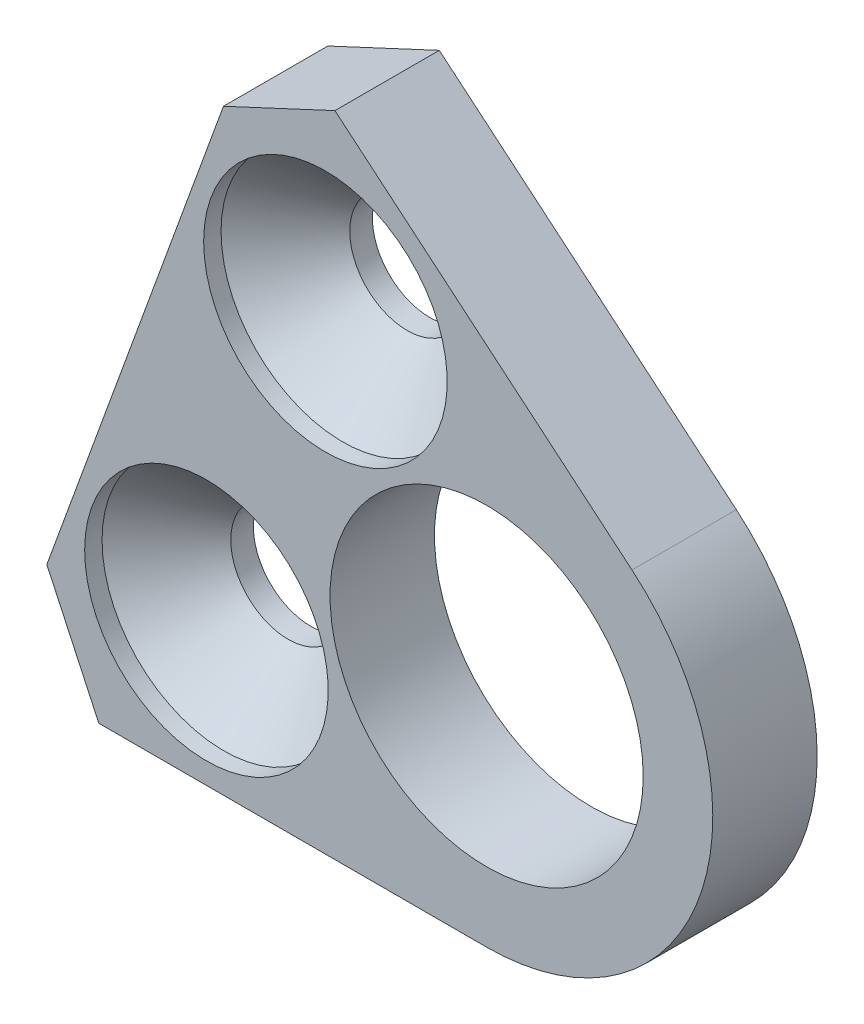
ISO-10303-21;
HEADER;
FILE_DESCRIPTION(('STEP AP214'),'2;1');
FILE_NAME('part.step','',(''),(''),'','','');
FILE_SCHEMA(('AUTOMOTIVE_DESIGN { 1 0 10303 214 1 1 1 1 }'));
ENDSEC;
DATA;
#1=APPLICATION_CONTEXT('core data for automotive mechanical design processes');
#2=APPLICATION_PROTOCOL_DEFINITION('international standard','automotive_design',2000,#1);
#3=PRODUCT_CONTEXT('',#1,'mechanical');
#4=PRODUCT('Part','Part','',(#3));
#5=PRODUCT_RELATED_PRODUCT_CATEGORY('part','',(#4));
#6=PRODUCT_DEFINITION_FORMATION('','',#4);
#7=PRODUCT_DEFINITION_CONTEXT('part definition',#1,'design');
#8=PRODUCT_DEFINITION('design','',#6,#7);
#9=PRODUCT_DEFINITION_SHAPE('','',#8);
#10=(LENGTH_UNIT() NAMED_UNIT(*) SI_UNIT(.MILLI.,.METRE.));
#11=(NAMED_UNIT(*) PLANE_ANGLE_UNIT() SI_UNIT($,.RADIAN.));
#12=(NAMED_UNIT(*) SI_UNIT($,.STERADIAN.) SOLID_ANGLE_UNIT());
#13=UNCERTAINTY_MEASURE_WITH_UNIT(LENGTH_MEASURE(1.E-05),#10,'distance_accuracy_value','');
#14=(GEOMETRIC_REPRESENTATION_CONTEXT(3) GLOBAL_UNCERTAINTY_ASSIGNED_CONTEXT((#13)) GLOBAL_UNIT_ASSIGNED_CONTEXT((#10,
#11,#12)) REPRESENTATION_CONTEXT('',''));
#15=CARTESIAN_POINT('',(0.,0.,0.));
#16=DIRECTION('',(0.,0.,1.));
#17=DIRECTION('',(1.,0.,0.));
#18=AXIS2_PLACEMENT_3D('',#15,#16,#17);
#19=CARTESIAN_POINT('',(-9.26578638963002,14.0137504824,-0.100000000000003));
#20=DIRECTION('',(0.,0.,-1.));
#21=DIRECTION('',(-1.,0.,0.));
#22=AXIS2_PLACEMENT_3D('',#19,#20,#21);
#23=CYLINDRICAL_SURFACE('',#22,7.);
#24=CARTESIAN_POINT('',(-9.26578638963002,14.0137504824,-1.0000000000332));
#25=DIRECTION('',(0.,0.,1.));
#26=DIRECTION('',(0.877582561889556,-0.479425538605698,0.));
#27=AXIS2_PLACEMENT_3D('',#24,#25,#26);
#28=CIRCLE('',#27,6.99999999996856);
#29=CARTESIAN_POINT('',(-16.26578638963,14.0137504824,-1.0000000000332));
#30=VERTEX_POINT('',#29);
#31=EDGE_CURVE('E127',#30,#30,#28,.F.);
#32=CARTESIAN_POINT('',(-9.26578638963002,14.0137504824,0.));
#33=DIRECTION('',(0.,0.,-1.));
#34=DIRECTION('',(-1.,0.,0.));
#35=AXIS2_PLACEMENT_3D('',#32,#33,#34);
#36=CIRCLE('',#35,7.);
#37=CARTESIAN_POINT('',(-16.26578638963,14.0137504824,0.));
#38=VERTEX_POINT('',#37);
#39=EDGE_CURVE('E20',#38,#38,#36,.T.);
#40=CARTESIAN_POINT('',(-16.26578638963,14.0137504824,-1.0000000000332));
#41=CARTESIAN_POINT('',(-16.26578638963,14.0137504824,-0.989583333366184));
#42=CARTESIAN_POINT('',(-16.26578638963,14.0137504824,-0.979166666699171));
#43=CARTESIAN_POINT('',(-16.26578638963,14.0137504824,-0.958333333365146));
#44=CARTESIAN_POINT('',(-16.26578638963,14.0137504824,-0.947916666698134));
#45=CARTESIAN_POINT('',(-16.26578638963,14.0137504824,-0.927083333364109));
#46=CARTESIAN_POINT('',(-16.26578638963,14.0137504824,-0.916666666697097));
#47=CARTESIAN_POINT('',(-16.26578638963,14.0137504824,-0.895833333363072));
#48=CARTESIAN_POINT('',(-16.26578638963,14.0137504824,-0.885416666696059));
#49=CARTESIAN_POINT('',(-16.26578638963,14.0137504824,-0.864583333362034));
#50=CARTESIAN_POINT('',(-16.26578638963,14.0137504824,-0.854166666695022));
#51=CARTESIAN_POINT('',(-16.26578638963,14.0137504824,-0.833333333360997));
#52=CARTESIAN_POINT('',(-16.26578638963,14.0137504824,-0.822916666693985));
#53=CARTESIAN_POINT('',(-16.26578638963,14.0137504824,-0.80208333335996));
#54=CARTESIAN_POINT('',(-16.26578638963,14.0137504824,-0.791666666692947));
#55=CARTESIAN_POINT('',(-16.26578638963,14.0137504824,-0.770833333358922));
#56=CARTESIAN_POINT('',(-16.26578638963,14.0137504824,-0.76041666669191));
#57=CARTESIAN_POINT('',(-16.26578638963,14.0137504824,-0.739583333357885));
#58=CARTESIAN_POINT('',(-16.26578638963,14.0137504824,-0.729166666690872));
#59=CARTESIAN_POINT('',(-16.26578638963,14.0137504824,-0.708333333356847));
#60=CARTESIAN_POINT('',(-16.26578638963,14.0137504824,-0.697916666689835));
#61=CARTESIAN_POINT('',(-16.26578638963,14.0137504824,-0.67708333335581));
#62=CARTESIAN_POINT('',(-16.26578638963,14.0137504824,-0.666666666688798));
#63=CARTESIAN_POINT('',(-16.26578638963,14.0137504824,-0.645833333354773));
#64=CARTESIAN_POINT('',(-16.26578638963,14.0137504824,-0.63541666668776));
#65=CARTESIAN_POINT('',(-16.26578638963,14.0137504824,-0.614583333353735));
#66=CARTESIAN_POINT('',(-16.26578638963,14.0137504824,-0.604166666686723));
#67=CARTESIAN_POINT('',(-16.26578638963,14.0137504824,-0.583333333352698));
#68=CARTESIAN_POINT('',(-16.26578638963,14.0137504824,-0.572916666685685));
#69=CARTESIAN_POINT('',(-16.26578638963,14.0137504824,-0.55208333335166));
#70=CARTESIAN_POINT('',(-16.26578638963,14.0137504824,-0.541666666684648));
#71=CARTESIAN_POINT('',(-16.26578638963,14.0137504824,-0.520833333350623));
#72=CARTESIAN_POINT('',(-16.26578638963,14.0137504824,-0.510416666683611));
#73=CARTESIAN_POINT('',(-16.26578638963,14.0137504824,-0.489583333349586));
#74=CARTESIAN_POINT('',(-16.26578638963,14.0137504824,-0.479166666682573));
#75=CARTESIAN_POINT('',(-16.26578638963,14.0137504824,-0.458333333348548));
#76=CARTESIAN_POINT('',(-16.26578638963,14.0137504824,-0.447916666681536));
#77=CARTESIAN_POINT('',(-16.26578638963,14.0137504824,-0.427083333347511));
#78=CARTESIAN_POINT('',(-16.26578638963,14.0137504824,-0.416666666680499));
#79=CARTESIAN_POINT('',(-16.26578638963,14.0137504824,-0.395833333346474));
#80=CARTESIAN_POINT('',(-16.26578638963,14.0137504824,-0.385416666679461));
#81=CARTESIAN_POINT('',(-16.26578638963,14.0137504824,-0.364583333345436));
#82=CARTESIAN_POINT('',(-16.26578638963,14.0137504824,-0.354166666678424));
#83=CARTESIAN_POINT('',(-16.26578638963,14.0137504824,-0.333333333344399));
#84=CARTESIAN_POINT('',(-16.26578638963,14.0137504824,-0.322916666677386));
#85=CARTESIAN_POINT('',(-16.26578638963,14.0137504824,-0.302083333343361));
#86=CARTESIAN_POINT('',(-16.26578638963,14.0137504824,-0.291666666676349));
#87=CARTESIAN_POINT('',(-16.26578638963,14.0137504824,-0.270833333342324));
#88=CARTESIAN_POINT('',(-16.26578638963,14.0137504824,-0.260416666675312));
#89=CARTESIAN_POINT('',(-16.26578638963,14.0137504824,-0.239583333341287));
#90=CARTESIAN_POINT('',(-16.26578638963,14.0137504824,-0.229166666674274));
#91=CARTESIAN_POINT('',(-16.26578638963,14.0137504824,-0.208333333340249));
#92=CARTESIAN_POINT('',(-16.26578638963,14.0137504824,-0.197916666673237));
#93=CARTESIAN_POINT('',(-16.26578638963,14.0137504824,-0.177083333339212));
#94=CARTESIAN_POINT('',(-16.26578638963,14.0137504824,-0.166666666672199));
#95=CARTESIAN_POINT('',(-16.26578638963,14.0137504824,-0.145833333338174));
#96=CARTESIAN_POINT('',(-16.26578638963,14.0137504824,-0.135416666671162));
#97=CARTESIAN_POINT('',(-16.26578638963,14.0137504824,-0.114583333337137));
#98=CARTESIAN_POINT('',(-16.26578638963,14.0137504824,-0.104166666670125));
#99=CARTESIAN_POINT('',(-16.26578638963,14.0137504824,-0.0833333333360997));
#100=CARTESIAN_POINT('',(-16.26578638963,14.0137504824,-0.0729166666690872));
#101=CARTESIAN_POINT('',(-16.26578638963,14.0137504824,-0.0520833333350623));
#102=CARTESIAN_POINT('',(-16.26578638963,14.0137504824,-0.0416666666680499));
#103=CARTESIAN_POINT('',(-16.26578638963,14.0137504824,-0.0208333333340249));
#104=CARTESIAN_POINT('',(-16.26578638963,14.0137504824,-0.0104166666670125));
#105=CARTESIAN_POINT('',(-16.26578638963,14.0137504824,0.));
#106=B_SPLINE_CURVE_WITH_KNOTS('',3,(#40,#41,#42,#43,#44,#45,#46,#47,#48,#49,#50,#51,#52,#53,
#54,#55,#56,#57,#58,#59,#60,#61,#62,#63,#64,#65,#66,#67,#68,#69,#70,#71,#72,#73,#74,#75,#76,#77,
#78,#79,#80,#81,#82,#83,#84,#85,#86,#87,#88,#89,#90,#91,#92,#93,#94,#95,#96,#97,#98,#99,#100,
#101,#102,#103,#104,#105),.UNSPECIFIED.,.F.,.F.,(4,2,2,2,2,2,2,2,2,2,2,2,2,2,2,2,2,2,2,2,2,2,2,
2,2,2,2,2,2,2,2,2,4),(0.,0.0312500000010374,0.0625000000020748,0.0937500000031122,
0.12500000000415,0.156250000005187,0.187500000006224,0.218750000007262,0.250000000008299,
0.281250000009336,0.312500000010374,0.343750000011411,0.375000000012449,0.406250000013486,
0.437500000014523,0.468750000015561,0.500000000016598,0.531250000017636,0.562500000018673,
0.59375000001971,0.625000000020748,0.656250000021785,0.687500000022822,0.71875000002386,
0.750000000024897,0.781250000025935,0.812500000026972,0.843750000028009,0.875000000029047,
0.906250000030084,0.937500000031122,0.968750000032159,1.0000000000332),.UNSPECIFIED.);
#107=EDGE_CURVE('BSEAM16',#30,#38,#106,.T.);
#108=ORIENTED_EDGE('',*,*,#31,.T.);
#109=ORIENTED_EDGE('',*,*,#39,.F.);
#110=ORIENTED_EDGE('',*,*,#107,.T.);
#111=ORIENTED_EDGE('',*,*,#107,.F.);
#112=EDGE_LOOP('',(#108,#110,#109,#111));
#113=FACE_BOUND('',#112,.T.);
#114=ADVANCED_FACE('F16',(#113),#23,.F.);
#115=CARTESIAN_POINT('',(-16.1058693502,-4.77922299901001,-0.100000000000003));
#116=DIRECTION('',(0.,0.,-1.));
#117=DIRECTION('',(-1.,0.,0.));
#118=AXIS2_PLACEMENT_3D('',#115,#116,#117);
#119=CYLINDRICAL_SURFACE('',#118,7.);
#120=CARTESIAN_POINT('',(-16.1058693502,-4.77922299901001,-1.0000000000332));
#121=DIRECTION('',(0.,0.,1.));
#122=DIRECTION('',(0.87758256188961,-0.479425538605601,0.));
#123=AXIS2_PLACEMENT_3D('',#120,#121,#122);
#124=CIRCLE('',#123,6.9999999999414);
#125=CARTESIAN_POINT('',(-23.1058693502,-4.77922299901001,-1.0000000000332));
#126=VERTEX_POINT('',#125);
#127=EDGE_CURVE('E124',#126,#126,#124,.F.);
#128=CARTESIAN_POINT('',(-16.1058693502,-4.77922299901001,0.));
#129=DIRECTION('',(0.,0.,-1.));
#130=DIRECTION('',(-1.,0.,0.));
#131=AXIS2_PLACEMENT_3D('',#128,#129,#130);
#132=CIRCLE('',#131,7.);
#133=CARTESIAN_POINT('',(-23.1058693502,-4.77922299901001,0.));
#134=VERTEX_POINT('',#133);
#135=EDGE_CURVE('E87',#134,#134,#132,.T.);
#136=CARTESIAN_POINT('',(-23.1058693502,-4.77922299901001,-1.0000000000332));
#137=CARTESIAN_POINT('',(-23.1058693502,-4.77922299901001,-0.989583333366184));
#138=CARTESIAN_POINT('',(-23.1058693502,-4.77922299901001,-0.979166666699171));
#139=CARTESIAN_POINT('',(-23.1058693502,-4.77922299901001,-0.958333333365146));
#140=CARTESIAN_POINT('',(-23.1058693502,-4.77922299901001,-0.947916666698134));
#141=CARTESIAN_POINT('',(-23.1058693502,-4.77922299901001,-0.927083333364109));
#142=CARTESIAN_POINT('',(-23.1058693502,-4.77922299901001,-0.916666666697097));
#143=CARTESIAN_POINT('',(-23.1058693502,-4.77922299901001,-0.895833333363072));
#144=CARTESIAN_POINT('',(-23.1058693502,-4.77922299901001,-0.885416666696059));
#145=CARTESIAN_POINT('',(-23.1058693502,-4.77922299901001,-0.864583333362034));
#146=CARTESIAN_POINT('',(-23.1058693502,-4.77922299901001,-0.854166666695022));
#147=CARTESIAN_POINT('',(-23.1058693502,-4.77922299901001,-0.833333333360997));
#148=CARTESIAN_POINT('',(-23.1058693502,-4.77922299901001,-0.822916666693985));
#149=CARTESIAN_POINT('',(-23.1058693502,-4.77922299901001,-0.80208333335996));
#150=CARTESIAN_POINT('',(-23.1058693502,-4.77922299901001,-0.791666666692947));
#151=CARTESIAN_POINT('',(-23.1058693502,-4.77922299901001,-0.770833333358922));
#152=CARTESIAN_POINT('',(-23.1058693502,-4.77922299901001,-0.76041666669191));
#153=CARTESIAN_POINT('',(-23.1058693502,-4.77922299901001,-0.739583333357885));
#154=CARTESIAN_POINT('',(-23.1058693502,-4.77922299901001,-0.729166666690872));
#155=CARTESIAN_POINT('',(-23.1058693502,-4.77922299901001,-0.708333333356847));
#156=CARTESIAN_POINT('',(-23.1058693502,-4.77922299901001,-0.697916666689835));
#157=CARTESIAN_POINT('',(-23.1058693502,-4.77922299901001,-0.67708333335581));
#158=CARTESIAN_POINT('',(-23.1058693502,-4.77922299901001,-0.666666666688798));
#159=CARTESIAN_POINT('',(-23.1058693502,-4.77922299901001,-0.645833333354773));
#160=CARTESIAN_POINT('',(-23.1058693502,-4.77922299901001,-0.63541666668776));
#161=CARTESIAN_POINT('',(-23.1058693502,-4.77922299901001,-0.614583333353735));
#162=CARTESIAN_POINT('',(-23.1058693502,-4.77922299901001,-0.604166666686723));
#163=CARTESIAN_POINT('',(-23.1058693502,-4.77922299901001,-0.583333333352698));
#164=CARTESIAN_POINT('',(-23.1058693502,-4.77922299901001,-0.572916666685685));
#165=CARTESIAN_POINT('',(-23.1058693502,-4.77922299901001,-0.55208333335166));
#166=CARTESIAN_POINT('',(-23.1058693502,-4.77922299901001,-0.541666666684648));
#167=CARTESIAN_POINT('',(-23.1058693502,-4.77922299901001,-0.520833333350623));
#168=CARTESIAN_POINT('',(-23.1058693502,-4.77922299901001,-0.510416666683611));
#169=CARTESIAN_POINT('',(-23.1058693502,-4.77922299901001,-0.489583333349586));
#170=CARTESIAN_POINT('',(-23.1058693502,-4.77922299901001,-0.479166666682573));
#171=CARTESIAN_POINT('',(-23.1058693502,-4.77922299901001,-0.458333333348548));
#172=CARTESIAN_POINT('',(-23.1058693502,-4.77922299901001,-0.447916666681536));
#173=CARTESIAN_POINT('',(-23.1058693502,-4.77922299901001,-0.427083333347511));
#174=CARTESIAN_POINT('',(-23.1058693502,-4.77922299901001,-0.416666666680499));
#175=CARTESIAN_POINT('',(-23.1058693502,-4.77922299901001,-0.395833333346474));
#176=CARTESIAN_POINT('',(-23.1058693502,-4.77922299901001,-0.385416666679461));
#177=CARTESIAN_POINT('',(-23.1058693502,-4.77922299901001,-0.364583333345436));
#178=CARTESIAN_POINT('',(-23.1058693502,-4.77922299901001,-0.354166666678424));
#179=CARTESIAN_POINT('',(-23.1058693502,-4.77922299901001,-0.333333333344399));
#180=CARTESIAN_POINT('',(-23.1058693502,-4.77922299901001,-0.322916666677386));
#181=CARTESIAN_POINT('',(-23.1058693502,-4.77922299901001,-0.302083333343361));
#182=CARTESIAN_POINT('',(-23.1058693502,-4.77922299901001,-0.291666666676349));
#183=CARTESIAN_POINT('',(-23.1058693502,-4.77922299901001,-0.270833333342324));
#184=CARTESIAN_POINT('',(-23.1058693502,-4.77922299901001,-0.260416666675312));
#185=CARTESIAN_POINT('',(-23.1058693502,-4.77922299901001,-0.239583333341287));
#186=CARTESIAN_POINT('',(-23.1058693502,-4.77922299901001,-0.229166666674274));
#187=CARTESIAN_POINT('',(-23.1058693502,-4.77922299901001,-0.208333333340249));
#188=CARTESIAN_POINT('',(-23.1058693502,-4.77922299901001,-0.197916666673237));
#189=CARTESIAN_POINT('',(-23.1058693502,-4.77922299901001,-0.177083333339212));
#190=CARTESIAN_POINT('',(-23.1058693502,-4.77922299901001,-0.166666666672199));
#191=CARTESIAN_POINT('',(-23.1058693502,-4.77922299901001,-0.145833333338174));
#192=CARTESIAN_POINT('',(-23.1058693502,-4.77922299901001,-0.135416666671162));
#193=CARTESIAN_POINT('',(-23.1058693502,-4.77922299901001,-0.114583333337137));
#194=CARTESIAN_POINT('',(-23.1058693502,-4.77922299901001,-0.104166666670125));
#195=CARTESIAN_POINT('',(-23.1058693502,-4.77922299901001,-0.0833333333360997));
#196=CARTESIAN_POINT('',(-23.1058693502,-4.77922299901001,-0.0729166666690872));
#197=CARTESIAN_POINT('',(-23.1058693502,-4.77922299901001,-0.0520833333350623));
#198=CARTESIAN_POINT('',(-23.1058693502,-4.77922299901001,-0.0416666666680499));
#199=CARTESIAN_POINT('',(-23.1058693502,-4.77922299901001,-0.0208333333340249));
#200=CARTESIAN_POINT('',(-23.1058693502,-4.77922299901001,-0.0104166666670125));
#201=CARTESIAN_POINT('',(-23.1058693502,-4.77922299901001,0.));
#202=B_SPLINE_CURVE_WITH_KNOTS('',3,(#136,#137,#138,#139,#140,#141,#142,#143,#144,#145,#146,
#147,#148,#149,#150,#151,#152,#153,#154,#155,#156,#157,#158,#159,#160,#161,#162,#163,#164,#165,
#166,#167,#168,#169,#170,#171,#172,#173,#174,#175,#176,#177,#178,#179,#180,#181,#182,#183,#184,
#185,#186,#187,#188,#189,#190,#191,#192,#193,#194,#195,#196,#197,#198,#199,#200,#201),
.UNSPECIFIED.,.F.,.F.,(4,2,2,2,2,2,2,2,2,2,2,2,2,2,2,2,2,2,2,2,2,2,2,2,2,2,2,2,2,2,2,2,4),(0.,
0.0312500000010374,0.0625000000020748,0.0937500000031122,0.12500000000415,0.156250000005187,
0.187500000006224,0.218750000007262,0.250000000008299,0.281250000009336,0.312500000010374,
0.343750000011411,0.375000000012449,0.406250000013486,0.437500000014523,0.468750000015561,
0.500000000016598,0.531250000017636,0.562500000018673,0.59375000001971,0.625000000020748,
0.656250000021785,0.687500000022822,0.71875000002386,0.750000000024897,0.781250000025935,
0.812500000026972,0.843750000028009,0.875000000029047,0.906250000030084,0.937500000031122,
0.968750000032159,1.0000000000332),.UNSPECIFIED.);
#203=EDGE_CURVE('BSEAM147',#126,#134,#202,.T.);
#204=ORIENTED_EDGE('',*,*,#127,.T.);
#205=ORIENTED_EDGE('',*,*,#135,.F.);
#206=ORIENTED_EDGE('',*,*,#203,.T.);
#207=ORIENTED_EDGE('',*,*,#203,.F.);
#208=EDGE_LOOP('',(#204,#206,#205,#207));
#209=FACE_BOUND('',#208,.T.);
#210=ADVANCED_FACE('F147',(#209),#119,.F.);
#211=CARTESIAN_POINT('',(-9.26578638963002,14.0137504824,-1.0000000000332));
#212=DIRECTION('',(0.,0.,1.));
#213=DIRECTION('',(1.,0.,0.));
#214=AXIS2_PLACEMENT_3D('',#211,#212,#213);
#215=CONICAL_SURFACE('',#214,6.99999999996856,0.785398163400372);
#216=ORIENTED_EDGE('',*,*,#31,.F.);
#217=EDGE_LOOP('',(#216));
#218=FACE_BOUND('',#217,.T.);
#219=CARTESIAN_POINT('',(-9.26578638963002,14.0137504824,-4.7));
#220=DIRECTION('',(0.,0.,-1.));
#221=DIRECTION('',(-1.,0.,0.));
#222=AXIS2_PLACEMENT_3D('',#219,#220,#221);
#223=CIRCLE('',#222,3.3);
#224=CARTESIAN_POINT('',(-12.56578638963,14.0137504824,-4.69999999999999));
#225=VERTEX_POINT('',#224);
#226=EDGE_CURVE('E103',#225,#225,#223,.T.);
#227=ORIENTED_EDGE('',*,*,#226,.T.);
#228=EDGE_LOOP('',(#227));
#229=FACE_BOUND('',#228,.T.);
#230=ADVANCED_FACE('F154',(#218,#229),#215,.F.);
#231=CARTESIAN_POINT('',(-16.1058693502,-4.77922299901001,-1.0000000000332));
#232=DIRECTION('',(0.,0.,1.));
#233=DIRECTION('',(1.,0.,0.));
#234=AXIS2_PLACEMENT_3D('',#231,#232,#233);
#235=CONICAL_SURFACE('',#234,6.9999999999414,0.78539816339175);
#236=ORIENTED_EDGE('',*,*,#127,.F.);
#237=EDGE_LOOP('',(#236));
#238=FACE_BOUND('',#237,.T.);
#239=CARTESIAN_POINT('',(-16.1058693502,-4.77922299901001,-4.7));
#240=DIRECTION('',(0.,0.,-1.));
#241=DIRECTION('',(-1.,0.,0.));
#242=AXIS2_PLACEMENT_3D('',#239,#240,#241);
#243=CIRCLE('',#242,3.3);
#244=CARTESIAN_POINT('',(-19.4058693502,-4.77922299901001,-4.69999999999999));
#245=VERTEX_POINT('',#244);
#246=EDGE_CURVE('E99',#245,#245,#243,.T.);
#247=ORIENTED_EDGE('',*,*,#246,.T.);
#248=EDGE_LOOP('',(#247));
#249=FACE_BOUND('',#248,.T.);
#250=ADVANCED_FACE('F236',(#238,#249),#235,.F.);
#251=CARTESIAN_POINT('',(0.,0.,0.));
#252=DIRECTION('',(0.,0.,1.));
#253=DIRECTION('',(1.,0.,0.));
#254=AXIS2_PLACEMENT_3D('',#251,#252,#253);
#255=PLANE('',#254);
#256=CARTESIAN_POINT('',(0.,0.,0.));
#257=DIRECTION('',(0.,0.,1.));
#258=DIRECTION('',(1.,0.,0.));
#259=AXIS2_PLACEMENT_3D('',#256,#257,#258);
#260=CIRCLE('',#259,9.);
#261=CARTESIAN_POINT('',(9.,0.,0.));
#262=VERTEX_POINT('',#261);
#263=EDGE_CURVE('E102',#262,#262,#260,.F.);
#264=ORIENTED_EDGE('',*,*,#263,.T.);
#265=EDGE_LOOP('',(#264));
#266=FACE_BOUND('',#265,.T.);
#267=ORIENTED_EDGE('',*,*,#135,.T.);
#268=EDGE_LOOP('',(#267));
#269=FACE_BOUND('',#268,.T.);
#270=ORIENTED_EDGE('',*,*,#39,.T.);
#271=EDGE_LOOP('',(#270));
#272=FACE_BOUND('',#271,.T.);
#273=DIRECTION('',(0.422618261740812,-0.906307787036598,0.));
#274=VECTOR('',#273,1.);
#275=CARTESIAN_POINT('',(-22.291,-12.999222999,0.));
#276=LINE('',#275,#274);
#277=CARTESIAN_POINT('',(-22.291,-12.999222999,0.));
#278=VERTEX_POINT('',#277);
#279=CARTESIAN_POINT('',(-25.2789111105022,-6.59162694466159,0.));
#280=VERTEX_POINT('',#279);
#281=EDGE_CURVE('E106',#278,#280,#276,.F.);
#282=ORIENTED_EDGE('',*,*,#281,.F.);
#283=DIRECTION('',(1.,0.,0.));
#284=VECTOR('',#283,1.);
#285=CARTESIAN_POINT('',(0.,-12.999222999,0.));
#286=LINE('',#285,#284);
#287=CARTESIAN_POINT('',(0.,-12.999222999,0.));
#288=VERTEX_POINT('',#287);
#289=EDGE_CURVE('E83',#288,#278,#286,.F.);
#290=ORIENTED_EDGE('',*,*,#289,.F.);
#291=CARTESIAN_POINT('',(0.,0.,0.));
#292=DIRECTION('',(0.,0.,1.));
#293=DIRECTION('',(1.,0.,0.));
#294=AXIS2_PLACEMENT_3D('',#291,#292,#293);
#295=CIRCLE('',#294,12.999222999);
#296=CARTESIAN_POINT('',(8.35573947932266,9.95798254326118,0.));
#297=VERTEX_POINT('',#296);
#298=EDGE_CURVE('E77',#297,#288,#295,.F.);
#299=ORIENTED_EDGE('',*,*,#298,.F.);
#300=DIRECTION('',(-0.766044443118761,0.642787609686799,0.));
#301=VECTOR('',#300,1.);
#302=CARTESIAN_POINT('',(-8.72015720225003,24.2863611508,0.));
#303=LINE('',#302,#301);
#304=CARTESIAN_POINT('',(-8.72015720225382,24.2863611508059,0.));
#305=VERTEX_POINT('',#304);
#306=EDGE_CURVE('E67',#305,#297,#303,.F.);
#307=ORIENTED_EDGE('',*,*,#306,.F.);
#308=DIRECTION('',(-0.906307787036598,-0.422618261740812,0.));
#309=VECTOR('',#308,1.);
#310=CARTESIAN_POINT('',(-15.1277532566,21.2984500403,0.));
#311=LINE('',#310,#309);
#312=CARTESIAN_POINT('',(-15.1277532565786,21.2984500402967,0.));
#313=VERTEX_POINT('',#312);
#314=EDGE_CURVE('E92',#313,#305,#311,.F.);
#315=ORIENTED_EDGE('',*,*,#314,.F.);
#316=DIRECTION('',(-0.342020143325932,-0.939692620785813,0.));
#317=VECTOR('',#316,1.);
#318=CARTESIAN_POINT('',(-25.2789111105,-6.59162694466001,0.));
#319=LINE('',#318,#317);
#320=EDGE_CURVE('E116',#280,#313,#319,.F.);
#321=ORIENTED_EDGE('',*,*,#320,.F.);
#322=EDGE_LOOP('',(#282,#290,#299,#307,#315,#321));
#323=FACE_BOUND('',#322,.T.);
#324=ADVANCED_FACE('F82',(#266,#269,#272,#323),#255,.T.);
#325=CARTESIAN_POINT('',(0.,0.,-3.));
#326=DIRECTION('',(0.,0.,1.));
#327=DIRECTION('',(1.,0.,0.));
#328=AXIS2_PLACEMENT_3D('',#325,#326,#327);
#329=CYLINDRICAL_SURFACE('',#328,12.999222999);
#330=ORIENTED_EDGE('',*,*,#298,.T.);
#331=DIRECTION('',(0.,0.,-1.));
#332=VECTOR('',#331,1.);
#333=CARTESIAN_POINT('',(0.,-12.999222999,0.));
#334=LINE('',#333,#332);
#335=CARTESIAN_POINT('',(0.,-12.999222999,-6.00000000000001));
#336=VERTEX_POINT('',#335);
#337=EDGE_CURVE('E113',#336,#288,#334,.F.);
#338=ORIENTED_EDGE('',*,*,#337,.F.);
#339=CARTESIAN_POINT('',(0.,0.,-6.00000000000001));
#340=DIRECTION('',(0.,0.,1.));
#341=DIRECTION('',(1.,0.,0.));
#342=AXIS2_PLACEMENT_3D('',#339,#340,#341);
#343=CIRCLE('',#342,12.999222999);
#344=CARTESIAN_POINT('',(8.35573947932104,9.95798254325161,-6.00000000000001));
#345=VERTEX_POINT('',#344);
#346=EDGE_CURVE('E91',#336,#345,#343,.T.);
#347=ORIENTED_EDGE('',*,*,#346,.T.);
#348=DIRECTION('',(0.,0.,1.));
#349=VECTOR('',#348,1.);
#350=CARTESIAN_POINT('',(8.35573947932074,9.95798254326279,0.));
#351=LINE('',#350,#349);
#352=EDGE_CURVE('E72',#297,#345,#351,.F.);
#353=ORIENTED_EDGE('',*,*,#352,.F.);
#354=EDGE_LOOP('',(#330,#338,#347,#353));
#355=FACE_BOUND('',#354,.T.);
#356=ADVANCED_FACE('F90',(#355),#329,.T.);
#357=CARTESIAN_POINT('',(-8.72015720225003,24.2863611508,0.));
#358=DIRECTION('',(0.642787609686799,0.766044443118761,0.));
#359=DIRECTION('',(-0.766044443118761,0.642787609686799,0.));
#360=AXIS2_PLACEMENT_3D('',#357,#358,#359);
#361=PLANE('',#360);
#362=ORIENTED_EDGE('',*,*,#306,.T.);
#363=ORIENTED_EDGE('',*,*,#352,.T.);
#364=DIRECTION('',(-0.766044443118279,0.642787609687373,0.));
#365=VECTOR('',#364,1.);
#366=CARTESIAN_POINT('',(8.35573947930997,9.95798254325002,-6.00000000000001));
#367=LINE('',#366,#365);
#368=CARTESIAN_POINT('',(-8.72015720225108,24.2863611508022,-6.00000000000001));
#369=VERTEX_POINT('',#368);
#370=EDGE_CURVE('E137',#345,#369,#367,.T.);
#371=ORIENTED_EDGE('',*,*,#370,.T.);
#372=DIRECTION('',(0.,0.,1.));
#373=VECTOR('',#372,1.);
#374=CARTESIAN_POINT('',(-8.72015720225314,24.2863611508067,0.));
#375=LINE('',#374,#373);
#376=EDGE_CURVE('E74',#305,#369,#375,.F.);
#377=ORIENTED_EDGE('',*,*,#376,.F.);
#378=EDGE_LOOP('',(#362,#363,#371,#377));
#379=FACE_BOUND('',#378,.T.);
#380=ADVANCED_FACE('F69',(#379),#361,.T.);
#381=CARTESIAN_POINT('',(-15.1277532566,21.2984500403,0.));
#382=DIRECTION('',(-0.422618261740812,0.906307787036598,0.));
#383=DIRECTION('',(-0.906307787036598,-0.422618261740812,0.));
#384=AXIS2_PLACEMENT_3D('',#381,#382,#383);
#385=PLANE('',#384);
#386=ORIENTED_EDGE('',*,*,#314,.T.);
#387=ORIENTED_EDGE('',*,*,#376,.T.);
#388=DIRECTION('',(-0.906307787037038,-0.422618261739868,0.));
#389=VECTOR('',#388,1.);
#390=CARTESIAN_POINT('',(-8.72015720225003,24.2863611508,-6.00000000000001));
#391=LINE('',#390,#389);
#392=CARTESIAN_POINT('',(-15.127753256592,21.2984500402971,-6.00000000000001));
#393=VERTEX_POINT('',#392);
#394=EDGE_CURVE('E185',#369,#393,#391,.T.);
#395=ORIENTED_EDGE('',*,*,#394,.T.);
#396=DIRECTION('',(0.,0.,1.));
#397=VECTOR('',#396,1.);
#398=CARTESIAN_POINT('',(-15.1277532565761,21.2984500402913,0.));
#399=LINE('',#398,#397);
#400=EDGE_CURVE('E109',#313,#393,#399,.F.);
#401=ORIENTED_EDGE('',*,*,#400,.F.);
#402=EDGE_LOOP('',(#386,#387,#395,#401));
#403=FACE_BOUND('',#402,.T.);
#404=ADVANCED_FACE('F199',(#403),#385,.T.);
#405=CARTESIAN_POINT('',(-25.2789111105,-6.59162694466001,0.));
#406=DIRECTION('',(-0.939692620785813,0.342020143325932,0.));
#407=DIRECTION('',(-0.342020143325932,-0.939692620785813,0.));
#408=AXIS2_PLACEMENT_3D('',#405,#406,#407);
#409=PLANE('',#408);
#410=ORIENTED_EDGE('',*,*,#320,.T.);
#411=ORIENTED_EDGE('',*,*,#400,.T.);
#412=DIRECTION('',(-0.342020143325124,-0.939692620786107,0.));
#413=VECTOR('',#412,1.);
#414=CARTESIAN_POINT('',(-15.1277532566,21.2984500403,-6.00000000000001));
#415=LINE('',#414,#413);
#416=CARTESIAN_POINT('',(-25.278911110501,-6.59162694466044,-6.00000000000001));
#417=VERTEX_POINT('',#416);
#418=EDGE_CURVE('E177',#393,#417,#415,.T.);
#419=ORIENTED_EDGE('',*,*,#418,.T.);
#420=DIRECTION('',(0.,0.,1.));
#421=VECTOR('',#420,1.);
#422=CARTESIAN_POINT('',(-25.2789111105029,-6.59162694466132,0.));
#423=LINE('',#422,#421);
#424=EDGE_CURVE('E108',#280,#417,#423,.F.);
#425=ORIENTED_EDGE('',*,*,#424,.F.);
#426=EDGE_LOOP('',(#410,#411,#419,#425));
#427=FACE_BOUND('',#426,.T.);
#428=ADVANCED_FACE('F183',(#427),#409,.T.);
#429=CARTESIAN_POINT('',(-22.291,-12.999222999,0.));
#430=DIRECTION('',(-0.906307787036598,-0.422618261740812,0.));
#431=DIRECTION('',(0.422618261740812,-0.906307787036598,0.));
#432=AXIS2_PLACEMENT_3D('',#429,#430,#431);
#433=PLANE('',#432);
#434=ORIENTED_EDGE('',*,*,#281,.T.);
#435=ORIENTED_EDGE('',*,*,#424,.T.);
#436=DIRECTION('',(0.42261826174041,-0.906307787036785,0.));
#437=VECTOR('',#436,1.);
#438=CARTESIAN_POINT('',(-25.2789111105,-6.59162694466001,-6.00000000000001));
#439=LINE('',#438,#437);
#440=CARTESIAN_POINT('',(-22.291,-12.999222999,-6.00000000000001));
#441=VERTEX_POINT('',#440);
#442=EDGE_CURVE('E174',#417,#441,#439,.T.);
#443=ORIENTED_EDGE('',*,*,#442,.T.);
#444=DIRECTION('',(0.,0.,-1.));
#445=VECTOR('',#444,1.);
#446=CARTESIAN_POINT('',(-22.291,-12.999222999,0.));
#447=LINE('',#446,#445);
#448=EDGE_CURVE('E35',#278,#441,#447,.T.);
#449=ORIENTED_EDGE('',*,*,#448,.F.);
#450=EDGE_LOOP('',(#434,#435,#443,#449));
#451=FACE_BOUND('',#450,.T.);
#452=ADVANCED_FACE('F212',(#451),#433,.T.);
#453=CARTESIAN_POINT('',(0.,-12.999222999,0.));
#454=DIRECTION('',(0.,-1.,0.));
#455=DIRECTION('',(0.,0.,-1.));
#456=AXIS2_PLACEMENT_3D('',#453,#454,#455);
#457=PLANE('',#456);
#458=ORIENTED_EDGE('',*,*,#289,.T.);
#459=ORIENTED_EDGE('',*,*,#448,.T.);
#460=DIRECTION('',(1.,0.,0.));
#461=VECTOR('',#460,1.);
#462=CARTESIAN_POINT('',(0.,-12.999222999,-6.00000000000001));
#463=LINE('',#462,#461);
#464=EDGE_CURVE('E135',#441,#336,#463,.T.);
#465=ORIENTED_EDGE('',*,*,#464,.T.);
#466=ORIENTED_EDGE('',*,*,#337,.T.);
#467=EDGE_LOOP('',(#458,#459,#465,#466));
#468=FACE_BOUND('',#467,.T.);
#469=ADVANCED_FACE('F215',(#468),#457,.T.);
#470=CARTESIAN_POINT('',(-9.26578638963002,14.0137504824,-0.100000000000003));
#471=DIRECTION('',(0.,0.,-1.));
#472=DIRECTION('',(-1.,0.,0.));
#473=AXIS2_PLACEMENT_3D('',#470,#471,#472);
#474=CYLINDRICAL_SURFACE('',#473,3.3);
#475=CARTESIAN_POINT('',(-9.26578638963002,14.0137504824,-6.00000000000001));
#476=DIRECTION('',(0.,0.,-1.));
#477=DIRECTION('',(-1.,0.,0.));
#478=AXIS2_PLACEMENT_3D('',#475,#476,#477);
#479=CIRCLE('',#478,3.3);
#480=CARTESIAN_POINT('',(-12.56578638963,14.0137504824,-6.00000000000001));
#481=VERTEX_POINT('',#480);
#482=EDGE_CURVE('E132',#481,#481,#479,.T.);
#483=CARTESIAN_POINT('',(-12.56578638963,14.0137504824,-4.69999999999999));
#484=CARTESIAN_POINT('',(-12.56578638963,14.0137504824,-4.71354166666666));
#485=CARTESIAN_POINT('',(-12.56578638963,14.0137504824,-4.72708333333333));
#486=CARTESIAN_POINT('',(-12.56578638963,14.0137504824,-4.75416666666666));
#487=CARTESIAN_POINT('',(-12.56578638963,14.0137504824,-4.76770833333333));
#488=CARTESIAN_POINT('',(-12.56578638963,14.0137504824,-4.79479166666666));
#489=CARTESIAN_POINT('',(-12.56578638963,14.0137504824,-4.80833333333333));
#490=CARTESIAN_POINT('',(-12.56578638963,14.0137504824,-4.83541666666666));
#491=CARTESIAN_POINT('',(-12.56578638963,14.0137504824,-4.84895833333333));
#492=CARTESIAN_POINT('',(-12.56578638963,14.0137504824,-4.87604166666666));
#493=CARTESIAN_POINT('',(-12.56578638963,14.0137504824,-4.88958333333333));
#494=CARTESIAN_POINT('',(-12.56578638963,14.0137504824,-4.91666666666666));
#495=CARTESIAN_POINT('',(-12.56578638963,14.0137504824,-4.93020833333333));
#496=CARTESIAN_POINT('',(-12.56578638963,14.0137504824,-4.95729166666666));
#497=CARTESIAN_POINT('',(-12.56578638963,14.0137504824,-4.97083333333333));
#498=CARTESIAN_POINT('',(-12.56578638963,14.0137504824,-4.99791666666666));
#499=CARTESIAN_POINT('',(-12.56578638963,14.0137504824,-5.01145833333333));
#500=CARTESIAN_POINT('',(-12.56578638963,14.0137504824,-5.03854166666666));
#501=CARTESIAN_POINT('',(-12.56578638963,14.0137504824,-5.05208333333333));
#502=CARTESIAN_POINT('',(-12.56578638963,14.0137504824,-5.07916666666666));
#503=CARTESIAN_POINT('',(-12.56578638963,14.0137504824,-5.09270833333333));
#504=CARTESIAN_POINT('',(-12.56578638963,14.0137504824,-5.11979166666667));
#505=CARTESIAN_POINT('',(-12.56578638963,14.0137504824,-5.13333333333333));
#506=CARTESIAN_POINT('',(-12.56578638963,14.0137504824,-5.16041666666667));
#507=CARTESIAN_POINT('',(-12.56578638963,14.0137504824,-5.17395833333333));
#508=CARTESIAN_POINT('',(-12.56578638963,14.0137504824,-5.20104166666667));
#509=CARTESIAN_POINT('',(-12.56578638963,14.0137504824,-5.21458333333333));
#510=CARTESIAN_POINT('',(-12.56578638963,14.0137504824,-5.24166666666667));
#511=CARTESIAN_POINT('',(-12.56578638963,14.0137504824,-5.25520833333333));
#512=CARTESIAN_POINT('',(-12.56578638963,14.0137504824,-5.28229166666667));
#513=CARTESIAN_POINT('',(-12.56578638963,14.0137504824,-5.29583333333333));
#514=CARTESIAN_POINT('',(-12.56578638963,14.0137504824,-5.32291666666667));
#515=CARTESIAN_POINT('',(-12.56578638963,14.0137504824,-5.33645833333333));
#516=CARTESIAN_POINT('',(-12.56578638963,14.0137504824,-5.36354166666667));
#517=CARTESIAN_POINT('',(-12.56578638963,14.0137504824,-5.37708333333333));
#518=CARTESIAN_POINT('',(-12.56578638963,14.0137504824,-5.40416666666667));
#519=CARTESIAN_POINT('',(-12.56578638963,14.0137504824,-5.41770833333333));
#520=CARTESIAN_POINT('',(-12.56578638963,14.0137504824,-5.44479166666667));
#521=CARTESIAN_POINT('',(-12.56578638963,14.0137504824,-5.45833333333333));
#522=CARTESIAN_POINT('',(-12.56578638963,14.0137504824,-5.48541666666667));
#523=CARTESIAN_POINT('',(-12.56578638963,14.0137504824,-5.49895833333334));
#524=CARTESIAN_POINT('',(-12.56578638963,14.0137504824,-5.52604166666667));
#525=CARTESIAN_POINT('',(-12.56578638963,14.0137504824,-5.53958333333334));
#526=CARTESIAN_POINT('',(-12.56578638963,14.0137504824,-5.56666666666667));
#527=CARTESIAN_POINT('',(-12.56578638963,14.0137504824,-5.58020833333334));
#528=CARTESIAN_POINT('',(-12.56578638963,14.0137504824,-5.60729166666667));
#529=CARTESIAN_POINT('',(-12.56578638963,14.0137504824,-5.62083333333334));
#530=CARTESIAN_POINT('',(-12.56578638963,14.0137504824,-5.64791666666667));
#531=CARTESIAN_POINT('',(-12.56578638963,14.0137504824,-5.66145833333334));
#532=CARTESIAN_POINT('',(-12.56578638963,14.0137504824,-5.68854166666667));
#533=CARTESIAN_POINT('',(-12.56578638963,14.0137504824,-5.70208333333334));
#534=CARTESIAN_POINT('',(-12.56578638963,14.0137504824,-5.72916666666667));
#535=CARTESIAN_POINT('',(-12.56578638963,14.0137504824,-5.74270833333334));
#536=CARTESIAN_POINT('',(-12.56578638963,14.0137504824,-5.76979166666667));
#537=CARTESIAN_POINT('',(-12.56578638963,14.0137504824,-5.78333333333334));
#538=CARTESIAN_POINT('',(-12.56578638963,14.0137504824,-5.81041666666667));
#539=CARTESIAN_POINT('',(-12.56578638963,14.0137504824,-5.82395833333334));
#540=CARTESIAN_POINT('',(-12.56578638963,14.0137504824,-5.85104166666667));
#541=CARTESIAN_POINT('',(-12.56578638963,14.0137504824,-5.86458333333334));
#542=CARTESIAN_POINT('',(-12.56578638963,14.0137504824,-5.89166666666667));
#543=CARTESIAN_POINT('',(-12.56578638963,14.0137504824,-5.90520833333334));
#544=CARTESIAN_POINT('',(-12.56578638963,14.0137504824,-5.93229166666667));
#545=CARTESIAN_POINT('',(-12.56578638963,14.0137504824,-5.94583333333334));
#546=CARTESIAN_POINT('',(-12.56578638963,14.0137504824,-5.97291666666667));
#547=CARTESIAN_POINT('',(-12.56578638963,14.0137504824,-5.98645833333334));
#548=CARTESIAN_POINT('',(-12.56578638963,14.0137504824,-6.00000000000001));
#549=B_SPLINE_CURVE_WITH_KNOTS('',3,(#483,#484,#485,#486,#487,#488,#489,#490,#491,#492,#493,
#494,#495,#496,#497,#498,#499,#500,#501,#502,#503,#504,#505,#506,#507,#508,#509,#510,#511,#512,
#513,#514,#515,#516,#517,#518,#519,#520,#521,#522,#523,#524,#525,#526,#527,#528,#529,#530,#531,
#532,#533,#534,#535,#536,#537,#538,#539,#540,#541,#542,#543,#544,#545,#546,#547,#548),
.UNSPECIFIED.,.F.,.F.,(4,2,2,2,2,2,2,2,2,2,2,2,2,2,2,2,2,2,2,2,2,2,2,2,2,2,2,2,2,2,2,2,4),(0.,
0.0406250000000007,0.0812500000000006,0.121875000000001,0.162500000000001,0.203125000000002,
0.243750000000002,0.284375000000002,0.325000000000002,0.365625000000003,0.406250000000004,
0.446875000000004,0.487500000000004,0.528125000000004,0.568750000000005,0.609375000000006,
0.650000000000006,0.690625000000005,0.731250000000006,0.771875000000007,0.812500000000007,
0.853125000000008,0.893750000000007,0.934375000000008,0.975000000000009,1.01562500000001,
1.05625000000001,1.09687500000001,1.13750000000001,1.17812500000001,1.21875000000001,
1.25937500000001,1.30000000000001),.UNSPECIFIED.);
#550=EDGE_CURVE('BSEAM221',#225,#481,#549,.T.);
#551=ORIENTED_EDGE('',*,*,#226,.F.);
#552=ORIENTED_EDGE('',*,*,#482,.T.);
#553=ORIENTED_EDGE('',*,*,#550,.T.);
#554=ORIENTED_EDGE('',*,*,#550,.F.);
#555=EDGE_LOOP('',(#551,#553,#552,#554));
#556=FACE_BOUND('',#555,.T.);
#557=ADVANCED_FACE('F221',(#556),#474,.F.);
#558=CARTESIAN_POINT('',(-16.1058693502,-4.77922299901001,-0.100000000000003));
#559=DIRECTION('',(0.,0.,-1.));
#560=DIRECTION('',(-1.,0.,0.));
#561=AXIS2_PLACEMENT_3D('',#558,#559,#560);
#562=CYLINDRICAL_SURFACE('',#561,3.3);
#563=CARTESIAN_POINT('',(-16.1058693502,-4.77922299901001,-6.00000000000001));
#564=DIRECTION('',(0.,0.,-1.));
#565=DIRECTION('',(-1.,0.,0.));
#566=AXIS2_PLACEMENT_3D('',#563,#564,#565);
#567=CIRCLE('',#566,3.3);
#568=CARTESIAN_POINT('',(-19.4058693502,-4.77922299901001,-6.00000000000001));
#569=VERTEX_POINT('',#568);
#570=EDGE_CURVE('E26',#569,#569,#567,.T.);
#571=CARTESIAN_POINT('',(-19.4058693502,-4.77922299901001,-4.69999999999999));
#572=CARTESIAN_POINT('',(-19.4058693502,-4.77922299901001,-4.71354166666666));
#573=CARTESIAN_POINT('',(-19.4058693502,-4.77922299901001,-4.72708333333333));
#574=CARTESIAN_POINT('',(-19.4058693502,-4.77922299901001,-4.75416666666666));
#575=CARTESIAN_POINT('',(-19.4058693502,-4.77922299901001,-4.76770833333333));
#576=CARTESIAN_POINT('',(-19.4058693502,-4.77922299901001,-4.79479166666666));
#577=CARTESIAN_POINT('',(-19.4058693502,-4.77922299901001,-4.80833333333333));
#578=CARTESIAN_POINT('',(-19.4058693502,-4.77922299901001,-4.83541666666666));
#579=CARTESIAN_POINT('',(-19.4058693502,-4.77922299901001,-4.84895833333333));
#580=CARTESIAN_POINT('',(-19.4058693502,-4.77922299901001,-4.87604166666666));
#581=CARTESIAN_POINT('',(-19.4058693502,-4.77922299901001,-4.88958333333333));
#582=CARTESIAN_POINT('',(-19.4058693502,-4.77922299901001,-4.91666666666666));
#583=CARTESIAN_POINT('',(-19.4058693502,-4.77922299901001,-4.93020833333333));
#584=CARTESIAN_POINT('',(-19.4058693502,-4.77922299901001,-4.95729166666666));
#585=CARTESIAN_POINT('',(-19.4058693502,-4.77922299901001,-4.97083333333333));
#586=CARTESIAN_POINT('',(-19.4058693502,-4.77922299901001,-4.99791666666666));
#587=CARTESIAN_POINT('',(-19.4058693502,-4.77922299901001,-5.01145833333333));
#588=CARTESIAN_POINT('',(-19.4058693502,-4.77922299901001,-5.03854166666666));
#589=CARTESIAN_POINT('',(-19.4058693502,-4.77922299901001,-5.05208333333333));
#590=CARTESIAN_POINT('',(-19.4058693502,-4.77922299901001,-5.07916666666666));
#591=CARTESIAN_POINT('',(-19.4058693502,-4.77922299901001,-5.09270833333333));
#592=CARTESIAN_POINT('',(-19.4058693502,-4.77922299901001,-5.11979166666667));
#593=CARTESIAN_POINT('',(-19.4058693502,-4.77922299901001,-5.13333333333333));
#594=CARTESIAN_POINT('',(-19.4058693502,-4.77922299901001,-5.16041666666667));
#595=CARTESIAN_POINT('',(-19.4058693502,-4.77922299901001,-5.17395833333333));
#596=CARTESIAN_POINT('',(-19.4058693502,-4.77922299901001,-5.20104166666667));
#597=CARTESIAN_POINT('',(-19.4058693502,-4.77922299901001,-5.21458333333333));
#598=CARTESIAN_POINT('',(-19.4058693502,-4.77922299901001,-5.24166666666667));
#599=CARTESIAN_POINT('',(-19.4058693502,-4.77922299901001,-5.25520833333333));
#600=CARTESIAN_POINT('',(-19.4058693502,-4.77922299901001,-5.28229166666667));
#601=CARTESIAN_POINT('',(-19.4058693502,-4.77922299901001,-5.29583333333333));
#602=CARTESIAN_POINT('',(-19.4058693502,-4.77922299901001,-5.32291666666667));
#603=CARTESIAN_POINT('',(-19.4058693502,-4.77922299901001,-5.33645833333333));
#604=CARTESIAN_POINT('',(-19.4058693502,-4.77922299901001,-5.36354166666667));
#605=CARTESIAN_POINT('',(-19.4058693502,-4.77922299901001,-5.37708333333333));
#606=CARTESIAN_POINT('',(-19.4058693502,-4.77922299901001,-5.40416666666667));
#607=CARTESIAN_POINT('',(-19.4058693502,-4.77922299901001,-5.41770833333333));
#608=CARTESIAN_POINT('',(-19.4058693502,-4.77922299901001,-5.44479166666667));
#609=CARTESIAN_POINT('',(-19.4058693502,-4.77922299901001,-5.45833333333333));
#610=CARTESIAN_POINT('',(-19.4058693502,-4.77922299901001,-5.48541666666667));
#611=CARTESIAN_POINT('',(-19.4058693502,-4.77922299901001,-5.49895833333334));
#612=CARTESIAN_POINT('',(-19.4058693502,-4.77922299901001,-5.52604166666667));
#613=CARTESIAN_POINT('',(-19.4058693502,-4.77922299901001,-5.53958333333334));
#614=CARTESIAN_POINT('',(-19.4058693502,-4.77922299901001,-5.56666666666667));
#615=CARTESIAN_POINT('',(-19.4058693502,-4.77922299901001,-5.58020833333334));
#616=CARTESIAN_POINT('',(-19.4058693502,-4.77922299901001,-5.60729166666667));
#617=CARTESIAN_POINT('',(-19.4058693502,-4.77922299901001,-5.62083333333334));
#618=CARTESIAN_POINT('',(-19.4058693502,-4.77922299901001,-5.64791666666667));
#619=CARTESIAN_POINT('',(-19.4058693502,-4.77922299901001,-5.66145833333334));
#620=CARTESIAN_POINT('',(-19.4058693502,-4.77922299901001,-5.68854166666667));
#621=CARTESIAN_POINT('',(-19.4058693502,-4.77922299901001,-5.70208333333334));
#622=CARTESIAN_POINT('',(-19.4058693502,-4.77922299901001,-5.72916666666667));
#623=CARTESIAN_POINT('',(-19.4058693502,-4.77922299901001,-5.74270833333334));
#624=CARTESIAN_POINT('',(-19.4058693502,-4.77922299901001,-5.76979166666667));
#625=CARTESIAN_POINT('',(-19.4058693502,-4.77922299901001,-5.78333333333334));
#626=CARTESIAN_POINT('',(-19.4058693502,-4.77922299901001,-5.81041666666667));
#627=CARTESIAN_POINT('',(-19.4058693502,-4.77922299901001,-5.82395833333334));
#628=CARTESIAN_POINT('',(-19.4058693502,-4.77922299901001,-5.85104166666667));
#629=CARTESIAN_POINT('',(-19.4058693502,-4.77922299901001,-5.86458333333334));
#630=CARTESIAN_POINT('',(-19.4058693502,-4.77922299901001,-5.89166666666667));
#631=CARTESIAN_POINT('',(-19.4058693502,-4.77922299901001,-5.90520833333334));
#632=CARTESIAN_POINT('',(-19.4058693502,-4.77922299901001,-5.93229166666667));
#633=CARTESIAN_POINT('',(-19.4058693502,-4.77922299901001,-5.94583333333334));
#634=CARTESIAN_POINT('',(-19.4058693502,-4.77922299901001,-5.97291666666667));
#635=CARTESIAN_POINT('',(-19.4058693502,-4.77922299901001,-5.98645833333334));
#636=CARTESIAN_POINT('',(-19.4058693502,-4.77922299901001,-6.00000000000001));
#637=B_SPLINE_CURVE_WITH_KNOTS('',3,(#571,#572,#573,#574,#575,#576,#577,#578,#579,#580,#581,
#582,#583,#584,#585,#586,#587,#588,#589,#590,#591,#592,#593,#594,#595,#596,#597,#598,#599,#600,
#601,#602,#603,#604,#605,#606,#607,#608,#609,#610,#611,#612,#613,#614,#615,#616,#617,#618,#619,
#620,#621,#622,#623,#624,#625,#626,#627,#628,#629,#630,#631,#632,#633,#634,#635,#636),
.UNSPECIFIED.,.F.,.F.,(4,2,2,2,2,2,2,2,2,2,2,2,2,2,2,2,2,2,2,2,2,2,2,2,2,2,2,2,2,2,2,2,4),(0.,
0.0406250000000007,0.0812500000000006,0.121875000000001,0.162500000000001,0.203125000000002,
0.243750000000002,0.284375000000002,0.325000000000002,0.365625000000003,0.406250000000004,
0.446875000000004,0.487500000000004,0.528125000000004,0.568750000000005,0.609375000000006,
0.650000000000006,0.690625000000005,0.731250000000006,0.771875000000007,0.812500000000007,
0.853125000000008,0.893750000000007,0.934375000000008,0.975000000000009,1.01562500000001,
1.05625000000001,1.09687500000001,1.13750000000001,1.17812500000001,1.21875000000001,
1.25937500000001,1.30000000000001),.UNSPECIFIED.);
#638=EDGE_CURVE('BSEAM163',#245,#569,#637,.T.);
#639=ORIENTED_EDGE('',*,*,#246,.F.);
#640=ORIENTED_EDGE('',*,*,#570,.T.);
#641=ORIENTED_EDGE('',*,*,#638,.T.);
#642=ORIENTED_EDGE('',*,*,#638,.F.);
#643=EDGE_LOOP('',(#639,#641,#640,#642));
#644=FACE_BOUND('',#643,.T.);
#645=ADVANCED_FACE('F163',(#644),#562,.F.);
#646=CARTESIAN_POINT('',(0.,0.,-3.));
#647=DIRECTION('',(0.,0.,1.));
#648=DIRECTION('',(1.,0.,0.));
#649=AXIS2_PLACEMENT_3D('',#646,#647,#648);
#650=CYLINDRICAL_SURFACE('',#649,9.);
#651=CARTESIAN_POINT('',(0.,0.,-6.00000000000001));
#652=DIRECTION('',(0.,0.,1.));
#653=DIRECTION('',(1.,0.,0.));
#654=AXIS2_PLACEMENT_3D('',#651,#652,#653);
#655=CIRCLE('',#654,9.);
#656=CARTESIAN_POINT('',(9.,0.,-6.00000000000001));
#657=VERTEX_POINT('',#656);
#658=EDGE_CURVE('E11',#657,#657,#655,.F.);
#659=CARTESIAN_POINT('',(9.,0.,0.));
#660=CARTESIAN_POINT('',(9.,0.,-0.0624999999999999));
#661=CARTESIAN_POINT('',(9.,0.,-0.125));
#662=CARTESIAN_POINT('',(9.,0.,-0.25));
#663=CARTESIAN_POINT('',(9.,0.,-0.3125));
#664=CARTESIAN_POINT('',(9.,0.,-0.4375));
#665=CARTESIAN_POINT('',(9.,0.,-0.5));
#666=CARTESIAN_POINT('',(9.,0.,-0.625));
#667=CARTESIAN_POINT('',(9.,0.,-0.687500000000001));
#668=CARTESIAN_POINT('',(9.,0.,-0.812500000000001));
#669=CARTESIAN_POINT('',(9.,0.,-0.875000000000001));
#670=CARTESIAN_POINT('',(9.,0.,-1.));
#671=CARTESIAN_POINT('',(9.,0.,-1.0625));
#672=CARTESIAN_POINT('',(9.,0.,-1.1875));
#673=CARTESIAN_POINT('',(9.,0.,-1.25));
#674=CARTESIAN_POINT('',(9.,0.,-1.375));
#675=CARTESIAN_POINT('',(9.,0.,-1.4375));
#676=CARTESIAN_POINT('',(9.,0.,-1.5625));
#677=CARTESIAN_POINT('',(9.,0.,-1.625));
#678=CARTESIAN_POINT('',(9.,0.,-1.75));
#679=CARTESIAN_POINT('',(9.,0.,-1.8125));
#680=CARTESIAN_POINT('',(9.,0.,-1.9375));
#681=CARTESIAN_POINT('',(9.,0.,-2.));
#682=CARTESIAN_POINT('',(9.,0.,-2.125));
#683=CARTESIAN_POINT('',(9.,0.,-2.1875));
#684=CARTESIAN_POINT('',(9.,0.,-2.3125));
#685=CARTESIAN_POINT('',(9.,0.,-2.375));
#686=CARTESIAN_POINT('',(9.,0.,-2.5));
#687=CARTESIAN_POINT('',(9.,0.,-2.5625));
#688=CARTESIAN_POINT('',(9.,0.,-2.6875));
#689=CARTESIAN_POINT('',(9.,0.,-2.75));
#690=CARTESIAN_POINT('',(9.,0.,-2.875));
#691=CARTESIAN_POINT('',(9.,0.,-2.9375));
#692=CARTESIAN_POINT('',(9.,0.,-3.0625));
#693=CARTESIAN_POINT('',(9.,0.,-3.125));
#694=CARTESIAN_POINT('',(9.,0.,-3.25));
#695=CARTESIAN_POINT('',(9.,0.,-3.3125));
#696=CARTESIAN_POINT('',(9.,0.,-3.4375));
#697=CARTESIAN_POINT('',(9.,0.,-3.5));
#698=CARTESIAN_POINT('',(9.,0.,-3.625));
#699=CARTESIAN_POINT('',(9.,0.,-3.6875));
#700=CARTESIAN_POINT('',(9.,0.,-3.8125));
#701=CARTESIAN_POINT('',(9.,0.,-3.875));
#702=CARTESIAN_POINT('',(9.,0.,-4.));
#703=CARTESIAN_POINT('',(9.,0.,-4.0625));
#704=CARTESIAN_POINT('',(9.,0.,-4.1875));
#705=CARTESIAN_POINT('',(9.,0.,-4.25));
#706=CARTESIAN_POINT('',(9.,0.,-4.375));
#707=CARTESIAN_POINT('',(9.,0.,-4.4375));
#708=CARTESIAN_POINT('',(9.,0.,-4.5625));
#709=CARTESIAN_POINT('',(9.,0.,-4.625));
#710=CARTESIAN_POINT('',(9.,0.,-4.75));
#711=CARTESIAN_POINT('',(9.,0.,-4.8125));
#712=CARTESIAN_POINT('',(9.,0.,-4.93750000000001));
#713=CARTESIAN_POINT('',(9.,0.,-5.00000000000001));
#714=CARTESIAN_POINT('',(9.,0.,-5.12500000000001));
#715=CARTESIAN_POINT('',(9.,0.,-5.18750000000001));
#716=CARTESIAN_POINT('',(9.,0.,-5.31250000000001));
#717=CARTESIAN_POINT('',(9.,0.,-5.37500000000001));
#718=CARTESIAN_POINT('',(9.,0.,-5.50000000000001));
#719=CARTESIAN_POINT('',(9.,0.,-5.56250000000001));
#720=CARTESIAN_POINT('',(9.,0.,-5.68750000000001));
#721=CARTESIAN_POINT('',(9.,0.,-5.75000000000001));
#722=CARTESIAN_POINT('',(9.,0.,-5.87500000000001));
#723=CARTESIAN_POINT('',(9.,0.,-5.93750000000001));
#724=CARTESIAN_POINT('',(9.,0.,-6.00000000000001));
#725=B_SPLINE_CURVE_WITH_KNOTS('',3,(#659,#660,#661,#662,#663,#664,#665,#666,#667,#668,#669,
#670,#671,#672,#673,#674,#675,#676,#677,#678,#679,#680,#681,#682,#683,#684,#685,#686,#687,#688,
#689,#690,#691,#692,#693,#694,#695,#696,#697,#698,#699,#700,#701,#702,#703,#704,#705,#706,#707,
#708,#709,#710,#711,#712,#713,#714,#715,#716,#717,#718,#719,#720,#721,#722,#723,#724),
.UNSPECIFIED.,.F.,.F.,(4,2,2,2,2,2,2,2,2,2,2,2,2,2,2,2,2,2,2,2,2,2,2,2,2,2,2,2,2,2,2,2,4),(0.,
0.1875,0.375,0.5625,0.750000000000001,0.937500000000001,1.125,1.3125,1.5,1.6875,1.875,2.0625,
2.25,2.4375,2.625,2.8125,3.,3.1875,3.375,3.5625,3.75,3.9375,4.125,4.3125,4.5,4.6875,4.875,
5.06250000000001,5.25000000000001,5.43750000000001,5.62500000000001,5.81250000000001,
6.00000000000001),.UNSPECIFIED.);
#726=EDGE_CURVE('BSEAM158',#262,#657,#725,.T.);
#727=ORIENTED_EDGE('',*,*,#263,.F.);
#728=ORIENTED_EDGE('',*,*,#658,.T.);
#729=ORIENTED_EDGE('',*,*,#726,.T.);
#730=ORIENTED_EDGE('',*,*,#726,.F.);
#731=EDGE_LOOP('',(#727,#729,#728,#730));
#732=FACE_BOUND('',#731,.T.);
#733=ADVANCED_FACE('F158',(#732),#650,.F.);
#734=CARTESIAN_POINT('',(0.,0.,-6.00000000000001));
#735=DIRECTION('',(0.,0.,1.));
#736=DIRECTION('',(1.,0.,0.));
#737=AXIS2_PLACEMENT_3D('',#734,#735,#736);
#738=PLANE('',#737);
#739=ORIENTED_EDGE('',*,*,#658,.F.);
#740=EDGE_LOOP('',(#739));
#741=FACE_BOUND('',#740,.T.);
#742=ORIENTED_EDGE('',*,*,#570,.F.);
#743=EDGE_LOOP('',(#742));
#744=FACE_BOUND('',#743,.T.);
#745=ORIENTED_EDGE('',*,*,#482,.F.);
#746=EDGE_LOOP('',(#745));
#747=FACE_BOUND('',#746,.T.);
#748=ORIENTED_EDGE('',*,*,#442,.F.);
#749=ORIENTED_EDGE('',*,*,#418,.F.);
#750=ORIENTED_EDGE('',*,*,#394,.F.);
#751=ORIENTED_EDGE('',*,*,#370,.F.);
#752=ORIENTED_EDGE('',*,*,#346,.F.);
#753=ORIENTED_EDGE('',*,*,#464,.F.);
#754=EDGE_LOOP('',(#748,#749,#750,#751,#752,#753));
#755=FACE_BOUND('',#754,.T.);
#756=ADVANCED_FACE('F18',(#741,#744,#747,#755),#738,.F.);
#757=CLOSED_SHELL('',(#114,#210,#230,#250,#324,#356,#380,#404,#428,#452,#469,#557,#645,#733,#756));
#758=MANIFOLD_SOLID_BREP('B1',#757);
#759=ADVANCED_BREP_SHAPE_REPRESENTATION('',(#18,#758),#14);
#760=SHAPE_DEFINITION_REPRESENTATION(#9,#759);
ENDSEC;
END-ISO-10303-21;
